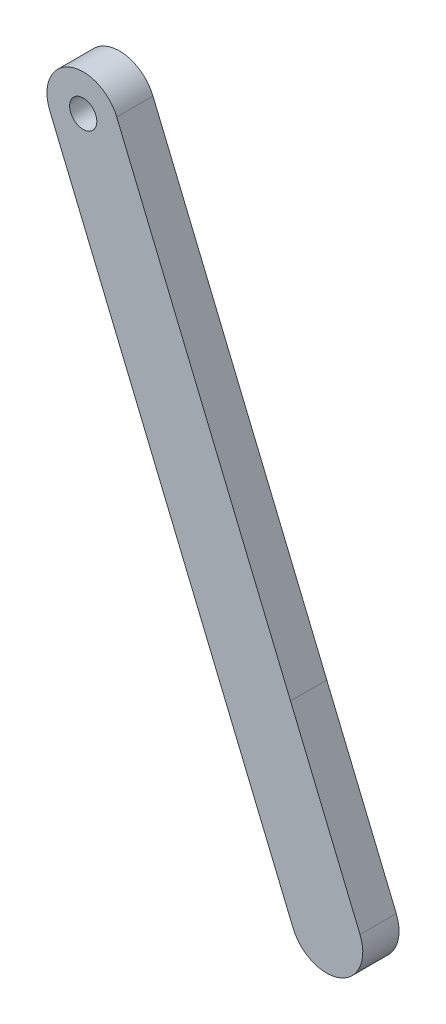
ISO-10303-21;
HEADER;
FILE_DESCRIPTION(('STEP AP214'),'2;1');
FILE_NAME('part.step','',(''),(''),'','','');
FILE_SCHEMA(('AUTOMOTIVE_DESIGN { 1 0 10303 214 1 1 1 1 }'));
ENDSEC;
DATA;
#1=APPLICATION_CONTEXT('core data for automotive mechanical design processes');
#2=APPLICATION_PROTOCOL_DEFINITION('international standard','automotive_design',2000,#1);
#3=PRODUCT_CONTEXT('',#1,'mechanical');
#4=PRODUCT('Part','Part','',(#3));
#5=PRODUCT_RELATED_PRODUCT_CATEGORY('part','',(#4));
#6=PRODUCT_DEFINITION_FORMATION('','',#4);
#7=PRODUCT_DEFINITION_CONTEXT('part definition',#1,'design');
#8=PRODUCT_DEFINITION('design','',#6,#7);
#9=PRODUCT_DEFINITION_SHAPE('','',#8);
#10=(LENGTH_UNIT() NAMED_UNIT(*) SI_UNIT(.MILLI.,.METRE.));
#11=(NAMED_UNIT(*) PLANE_ANGLE_UNIT() SI_UNIT($,.RADIAN.));
#12=(NAMED_UNIT(*) SI_UNIT($,.STERADIAN.) SOLID_ANGLE_UNIT());
#13=UNCERTAINTY_MEASURE_WITH_UNIT(LENGTH_MEASURE(1.E-05),#10,'distance_accuracy_value','');
#14=(GEOMETRIC_REPRESENTATION_CONTEXT(3) GLOBAL_UNCERTAINTY_ASSIGNED_CONTEXT((#13)) GLOBAL_UNIT_ASSIGNED_CONTEXT((#10,
#11,#12)) REPRESENTATION_CONTEXT('',''));
#15=CARTESIAN_POINT('',(0.,0.,0.));
#16=DIRECTION('',(0.,0.,1.));
#17=DIRECTION('',(1.,0.,0.));
#18=AXIS2_PLACEMENT_3D('',#15,#16,#17);
#19=CARTESIAN_POINT('',(-4.83627660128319,-2.00691336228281,4.));
#20=DIRECTION('',(0.923632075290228,0.383280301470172,0.));
#21=DIRECTION('',(-0.383280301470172,0.923632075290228,0.));
#22=AXIS2_PLACEMENT_3D('',#19,#20,#21);
#23=PLANE('',#22);
#24=DIRECTION('',(0.383280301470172,-0.923632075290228,0.));
#25=VECTOR('',#24,1.);
#26=CARTESIAN_POINT('',(-4.83627660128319,-2.00691336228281,0.));
#27=LINE('',#26,#25);
#28=CARTESIAN_POINT('',(-15.8873220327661,24.6239883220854,0.));
#29=VERTEX_POINT('',#28);
#30=CARTESIAN_POINT('',(3.27669304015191,-21.5576154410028,0.));
#31=VERTEX_POINT('',#30);
#32=EDGE_CURVE('E132',#29,#31,#27,.T.);
#33=ORIENTED_EDGE('',*,*,#32,.F.);
#34=DIRECTION('',(0.,0.,-1.));
#35=VECTOR('',#34,1.);
#36=CARTESIAN_POINT('',(-15.8873220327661,24.6239883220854,4.));
#37=LINE('',#36,#35);
#38=CARTESIAN_POINT('',(-15.8873220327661,24.6239883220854,4.));
#39=VERTEX_POINT('',#38);
#40=EDGE_CURVE('E11',#39,#29,#37,.T.);
#41=ORIENTED_EDGE('',*,*,#40,.F.);
#42=DIRECTION('',(0.383280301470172,-0.923632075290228,0.));
#43=VECTOR('',#42,1.);
#44=CARTESIAN_POINT('',(-4.83627660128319,-2.00691336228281,4.));
#45=LINE('',#44,#43);
#46=CARTESIAN_POINT('',(3.27669304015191,-21.5576154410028,4.));
#47=VERTEX_POINT('',#46);
#48=EDGE_CURVE('E151',#39,#47,#45,.T.);
#49=ORIENTED_EDGE('',*,*,#48,.T.);
#50=DIRECTION('',(0.,0.,-1.));
#51=VECTOR('',#50,1.);
#52=CARTESIAN_POINT('',(3.27669304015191,-21.5576154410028,4.));
#53=LINE('',#52,#51);
#54=EDGE_CURVE('E55',#47,#31,#53,.T.);
#55=ORIENTED_EDGE('',*,*,#54,.T.);
#56=EDGE_LOOP('',(#33,#41,#49,#55));
#57=FACE_BOUND('',#56,.T.);
#58=ADVANCED_FACE('F39',(#57),#23,.T.);
#59=CARTESIAN_POINT('',(-19.581850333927,23.0908671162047,4.));
#60=DIRECTION('',(0.,0.,-1.));
#61=DIRECTION('',(-1.,0.,0.));
#62=AXIS2_PLACEMENT_3D('',#59,#60,#61);
#63=CYLINDRICAL_SURFACE('',#62,4.00000000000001);
#64=CARTESIAN_POINT('',(-19.581850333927,23.0908671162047,0.));
#65=DIRECTION('',(0.,0.,1.));
#66=DIRECTION('',(1.,0.,0.));
#67=AXIS2_PLACEMENT_3D('',#64,#65,#66);
#68=CIRCLE('',#67,4.00000000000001);
#69=CARTESIAN_POINT('',(-23.2763890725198,21.5577710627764,0.));
#70=VERTEX_POINT('',#69);
#71=EDGE_CURVE('E134',#29,#70,#68,.T.);
#72=ORIENTED_EDGE('',*,*,#71,.T.);
#73=DIRECTION('',(0.,0.,-1.));
#74=VECTOR('',#73,1.);
#75=CARTESIAN_POINT('',(-23.2763890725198,21.5577710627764,4.));
#76=LINE('',#75,#74);
#77=CARTESIAN_POINT('',(-23.2763890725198,21.5577710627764,4.));
#78=VERTEX_POINT('',#77);
#79=EDGE_CURVE('E47',#78,#70,#76,.T.);
#80=ORIENTED_EDGE('',*,*,#79,.F.);
#81=CARTESIAN_POINT('',(-19.581850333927,23.0908671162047,4.));
#82=DIRECTION('',(0.,0.,1.));
#83=DIRECTION('',(1.,0.,0.));
#84=AXIS2_PLACEMENT_3D('',#81,#82,#83);
#85=CIRCLE('',#84,4.00000000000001);
#86=EDGE_CURVE('E171',#39,#78,#85,.T.);
#87=ORIENTED_EDGE('',*,*,#86,.F.);
#88=ORIENTED_EDGE('',*,*,#40,.T.);
#89=EDGE_LOOP('',(#72,#80,#87,#88));
#90=FACE_BOUND('',#89,.T.);
#91=ADVANCED_FACE('F164',(#90),#63,.T.);
#92=CARTESIAN_POINT('',(-12.2255490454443,-5.07314777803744,4.));
#93=DIRECTION('',(-0.923634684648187,-0.38327401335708,0.));
#94=DIRECTION('',(0.38327401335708,-0.923634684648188,0.));
#95=AXIS2_PLACEMENT_3D('',#92,#93,#94);
#96=PLANE('',#95);
#97=DIRECTION('',(-0.38327401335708,0.923634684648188,0.));
#98=VECTOR('',#97,1.);
#99=CARTESIAN_POINT('',(-12.2255490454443,-5.07314777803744,0.));
#100=LINE('',#99,#98);
#101=CARTESIAN_POINT('',(-13.6945387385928,-1.53309605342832,0.));
#102=VERTEX_POINT('',#101);
#103=EDGE_CURVE('E137',#102,#70,#100,.T.);
#104=ORIENTED_EDGE('',*,*,#103,.F.);
#105=DIRECTION('',(0.,0.,-1.));
#106=VECTOR('',#105,1.);
#107=CARTESIAN_POINT('',(-13.6945387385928,-1.53309605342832,4.));
#108=LINE('',#107,#106);
#109=CARTESIAN_POINT('',(-13.6945387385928,-1.53309605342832,4.));
#110=VERTEX_POINT('',#109);
#111=EDGE_CURVE('E155',#110,#102,#108,.T.);
#112=ORIENTED_EDGE('',*,*,#111,.F.);
#113=DIRECTION('',(-0.38327401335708,0.923634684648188,0.));
#114=VECTOR('',#113,1.);
#115=CARTESIAN_POINT('',(-12.2255490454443,-5.07314777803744,4.));
#116=LINE('',#115,#114);
#117=EDGE_CURVE('E161',#110,#78,#116,.T.);
#118=ORIENTED_EDGE('',*,*,#117,.T.);
#119=ORIENTED_EDGE('',*,*,#79,.T.);
#120=EDGE_LOOP('',(#104,#112,#118,#119));
#121=FACE_BOUND('',#120,.T.);
#122=ADVANCED_FACE('F160',(#121),#96,.T.);
#123=CARTESIAN_POINT('',(-12.2256663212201,-5.073001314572,4.));
#124=DIRECTION('',(0.923639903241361,0.383261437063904,0.));
#125=DIRECTION('',(-0.383261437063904,0.923639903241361,0.));
#126=AXIS2_PLACEMENT_3D('',#123,#124,#125);
#127=PLANE('',#126);
#128=DIRECTION('',(0.383261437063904,-0.923639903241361,0.));
#129=VECTOR('',#128,1.);
#130=CARTESIAN_POINT('',(-12.2256663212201,-5.073001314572,0.));
#131=LINE('',#130,#129);
#132=CARTESIAN_POINT('',(-4.11302368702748,-24.6240433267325,0.));
#133=VERTEX_POINT('',#132);
#134=EDGE_CURVE('E140',#102,#133,#131,.T.);
#135=ORIENTED_EDGE('',*,*,#134,.T.);
#136=DIRECTION('',(0.,0.,-1.));
#137=VECTOR('',#136,1.);
#138=CARTESIAN_POINT('',(-4.11302368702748,-24.6240433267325,4.));
#139=LINE('',#138,#137);
#140=CARTESIAN_POINT('',(-4.11302368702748,-24.6240433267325,4.));
#141=VERTEX_POINT('',#140);
#142=EDGE_CURVE('E121',#141,#133,#139,.T.);
#143=ORIENTED_EDGE('',*,*,#142,.F.);
#144=DIRECTION('',(0.383261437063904,-0.923639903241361,0.));
#145=VECTOR('',#144,1.);
#146=CARTESIAN_POINT('',(-12.2256663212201,-5.073001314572,4.));
#147=LINE('',#146,#145);
#148=EDGE_CURVE('E109',#110,#141,#147,.T.);
#149=ORIENTED_EDGE('',*,*,#148,.F.);
#150=ORIENTED_EDGE('',*,*,#111,.T.);
#151=EDGE_LOOP('',(#135,#143,#149,#150));
#152=FACE_BOUND('',#151,.T.);
#153=ADVANCED_FACE('F170',(#152),#127,.F.);
#154=CARTESIAN_POINT('',(-12.2258735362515,-5.07329241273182,4.));
#155=DIRECTION('',(0.923634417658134,0.383274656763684,0.));
#156=DIRECTION('',(-0.383274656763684,0.923634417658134,0.));
#157=AXIS2_PLACEMENT_3D('',#154,#155,#156);
#158=PLANE('',#157);
#159=DIRECTION('',(0.383274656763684,-0.923634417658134,0.));
#160=VECTOR('',#159,1.);
#161=CARTESIAN_POINT('',(-12.2258735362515,-5.07329241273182,0.));
#162=LINE('',#161,#160);
#163=CARTESIAN_POINT('',(3.55251333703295,-43.0968374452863,0.));
#164=VERTEX_POINT('',#163);
#165=EDGE_CURVE('E118',#133,#164,#162,.T.);
#166=ORIENTED_EDGE('',*,*,#165,.T.);
#167=DIRECTION('',(0.,0.,-1.));
#168=VECTOR('',#167,1.);
#169=CARTESIAN_POINT('',(3.55251333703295,-43.0968374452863,4.));
#170=LINE('',#169,#168);
#171=CARTESIAN_POINT('',(3.55251333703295,-43.0968374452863,4.));
#172=VERTEX_POINT('',#171);
#173=EDGE_CURVE('E115',#172,#164,#170,.T.);
#174=ORIENTED_EDGE('',*,*,#173,.F.);
#175=DIRECTION('',(0.383274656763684,-0.923634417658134,0.));
#176=VECTOR('',#175,1.);
#177=CARTESIAN_POINT('',(-12.2258735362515,-5.07329241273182,4.));
#178=LINE('',#177,#176);
#179=EDGE_CURVE('E99',#141,#172,#178,.T.);
#180=ORIENTED_EDGE('',*,*,#179,.F.);
#181=ORIENTED_EDGE('',*,*,#142,.T.);
#182=EDGE_LOOP('',(#166,#174,#180,#181));
#183=FACE_BOUND('',#182,.T.);
#184=ADVANCED_FACE('F116',(#183),#158,.F.);
#185=CARTESIAN_POINT('',(7.24734611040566,-41.5636163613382,4.));
#186=DIRECTION('',(0.,0.,-1.));
#187=DIRECTION('',(-1.,0.,0.));
#188=AXIS2_PLACEMENT_3D('',#185,#186,#187);
#189=CYLINDRICAL_SURFACE('',#188,4.00031950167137);
#190=CARTESIAN_POINT('',(7.24734611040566,-41.5636163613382,0.));
#191=DIRECTION('',(0.,0.,1.));
#192=DIRECTION('',(1.,0.,0.));
#193=AXIS2_PLACEMENT_3D('',#190,#191,#192);
#194=CIRCLE('',#193,4.00031950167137);
#195=CARTESIAN_POINT('',(10.9421820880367,-40.0304029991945,0.));
#196=VERTEX_POINT('',#195);
#197=EDGE_CURVE('E143',#164,#196,#194,.T.);
#198=ORIENTED_EDGE('',*,*,#197,.T.);
#199=DIRECTION('',(0.,0.,-1.));
#200=VECTOR('',#199,1.);
#201=CARTESIAN_POINT('',(10.9421820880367,-40.0304029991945,4.));
#202=LINE('',#201,#200);
#203=CARTESIAN_POINT('',(10.9421820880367,-40.0304029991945,4.));
#204=VERTEX_POINT('',#203);
#205=EDGE_CURVE('E78',#204,#196,#202,.T.);
#206=ORIENTED_EDGE('',*,*,#205,.F.);
#207=CARTESIAN_POINT('',(7.24734611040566,-41.5636163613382,4.));
#208=DIRECTION('',(0.,0.,1.));
#209=DIRECTION('',(1.,0.,0.));
#210=AXIS2_PLACEMENT_3D('',#207,#208,#209);
#211=CIRCLE('',#210,4.00031950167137);
#212=EDGE_CURVE('E106',#172,#204,#211,.T.);
#213=ORIENTED_EDGE('',*,*,#212,.F.);
#214=ORIENTED_EDGE('',*,*,#173,.T.);
#215=EDGE_LOOP('',(#198,#206,#213,#214));
#216=FACE_BOUND('',#215,.T.);
#217=ADVANCED_FACE('F123',(#216),#189,.T.);
#218=CARTESIAN_POINT('',(-4.83613271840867,-2.00680716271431,4.));
#219=DIRECTION('',(0.923635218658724,0.383272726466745,0.));
#220=DIRECTION('',(-0.383272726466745,0.923635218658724,0.));
#221=AXIS2_PLACEMENT_3D('',#218,#219,#220);
#222=PLANE('',#221);
#223=DIRECTION('',(0.383272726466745,-0.923635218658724,0.));
#224=VECTOR('',#223,1.);
#225=CARTESIAN_POINT('',(-4.83613271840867,-2.00680716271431,0.));
#226=LINE('',#225,#224);
#227=EDGE_CURVE('E145',#31,#196,#226,.T.);
#228=ORIENTED_EDGE('',*,*,#227,.F.);
#229=ORIENTED_EDGE('',*,*,#54,.F.);
#230=DIRECTION('',(0.383272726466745,-0.923635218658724,0.));
#231=VECTOR('',#230,1.);
#232=CARTESIAN_POINT('',(-4.83613271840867,-2.00680716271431,4.));
#233=LINE('',#232,#231);
#234=EDGE_CURVE('E124',#47,#204,#233,.T.);
#235=ORIENTED_EDGE('',*,*,#234,.T.);
#236=ORIENTED_EDGE('',*,*,#205,.T.);
#237=EDGE_LOOP('',(#228,#229,#235,#236));
#238=FACE_BOUND('',#237,.T.);
#239=ADVANCED_FACE('F175',(#238),#222,.T.);
#240=CARTESIAN_POINT('',(-19.581850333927,23.0908671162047,4.));
#241=DIRECTION('',(0.,0.,-1.));
#242=DIRECTION('',(-1.,0.,0.));
#243=AXIS2_PLACEMENT_3D('',#240,#241,#242);
#244=CYLINDRICAL_SURFACE('',#243,1.5);
#245=CARTESIAN_POINT('',(-19.581850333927,23.0908671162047,4.));
#246=DIRECTION('',(0.,0.,1.));
#247=DIRECTION('',(1.,0.,0.));
#248=AXIS2_PLACEMENT_3D('',#245,#246,#247);
#249=CIRCLE('',#248,1.5);
#250=CARTESIAN_POINT('',(-18.081850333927,23.0908671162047,4.));
#251=VERTEX_POINT('',#250);
#252=EDGE_CURVE('E126',#251,#251,#249,.T.);
#253=ORIENTED_EDGE('',*,*,#252,.T.);
#254=EDGE_LOOP('',(#253));
#255=FACE_BOUND('',#254,.T.);
#256=CARTESIAN_POINT('',(-19.581850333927,23.0908671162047,0.));
#257=DIRECTION('',(0.,0.,1.));
#258=DIRECTION('',(1.,0.,0.));
#259=AXIS2_PLACEMENT_3D('',#256,#257,#258);
#260=CIRCLE('',#259,1.5);
#261=CARTESIAN_POINT('',(-18.081850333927,23.0908671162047,0.));
#262=VERTEX_POINT('',#261);
#263=EDGE_CURVE('E148',#262,#262,#260,.T.);
#264=ORIENTED_EDGE('',*,*,#263,.F.);
#265=EDGE_LOOP('',(#264));
#266=FACE_BOUND('',#265,.T.);
#267=ADVANCED_FACE('F177',(#255,#266),#244,.F.);
#268=CARTESIAN_POINT('',(0.,0.,4.));
#269=DIRECTION('',(0.,0.,1.));
#270=DIRECTION('',(1.,0.,0.));
#271=AXIS2_PLACEMENT_3D('',#268,#269,#270);
#272=PLANE('',#271);
#273=ORIENTED_EDGE('',*,*,#48,.F.);
#274=ORIENTED_EDGE('',*,*,#86,.T.);
#275=ORIENTED_EDGE('',*,*,#117,.F.);
#276=ORIENTED_EDGE('',*,*,#148,.T.);
#277=ORIENTED_EDGE('',*,*,#179,.T.);
#278=ORIENTED_EDGE('',*,*,#212,.T.);
#279=ORIENTED_EDGE('',*,*,#234,.F.);
#280=EDGE_LOOP('',(#273,#274,#275,#276,#277,#278,#279));
#281=FACE_BOUND('',#280,.T.);
#282=ORIENTED_EDGE('',*,*,#252,.F.);
#283=EDGE_LOOP('',(#282));
#284=FACE_BOUND('',#283,.T.);
#285=ADVANCED_FACE('F102',(#281,#284),#272,.T.);
#286=CARTESIAN_POINT('',(0.,0.,0.));
#287=DIRECTION('',(0.,0.,1.));
#288=DIRECTION('',(1.,0.,0.));
#289=AXIS2_PLACEMENT_3D('',#286,#287,#288);
#290=PLANE('',#289);
#291=ORIENTED_EDGE('',*,*,#32,.T.);
#292=ORIENTED_EDGE('',*,*,#227,.T.);
#293=ORIENTED_EDGE('',*,*,#197,.F.);
#294=ORIENTED_EDGE('',*,*,#165,.F.);
#295=ORIENTED_EDGE('',*,*,#134,.F.);
#296=ORIENTED_EDGE('',*,*,#103,.T.);
#297=ORIENTED_EDGE('',*,*,#71,.F.);
#298=EDGE_LOOP('',(#291,#292,#293,#294,#295,#296,#297));
#299=FACE_BOUND('',#298,.T.);
#300=ORIENTED_EDGE('',*,*,#263,.T.);
#301=EDGE_LOOP('',(#300));
#302=FACE_BOUND('',#301,.T.);
#303=ADVANCED_FACE('F167',(#299,#302),#290,.F.);
#304=CLOSED_SHELL('',(#58,#91,#122,#153,#184,#217,#239,#267,#285,#303));
#305=MANIFOLD_SOLID_BREP('B2',#304);
#306=ADVANCED_BREP_SHAPE_REPRESENTATION('',(#18,#305),#14);
#307=SHAPE_DEFINITION_REPRESENTATION(#9,#306);
ENDSEC;
END-ISO-10303-21;
